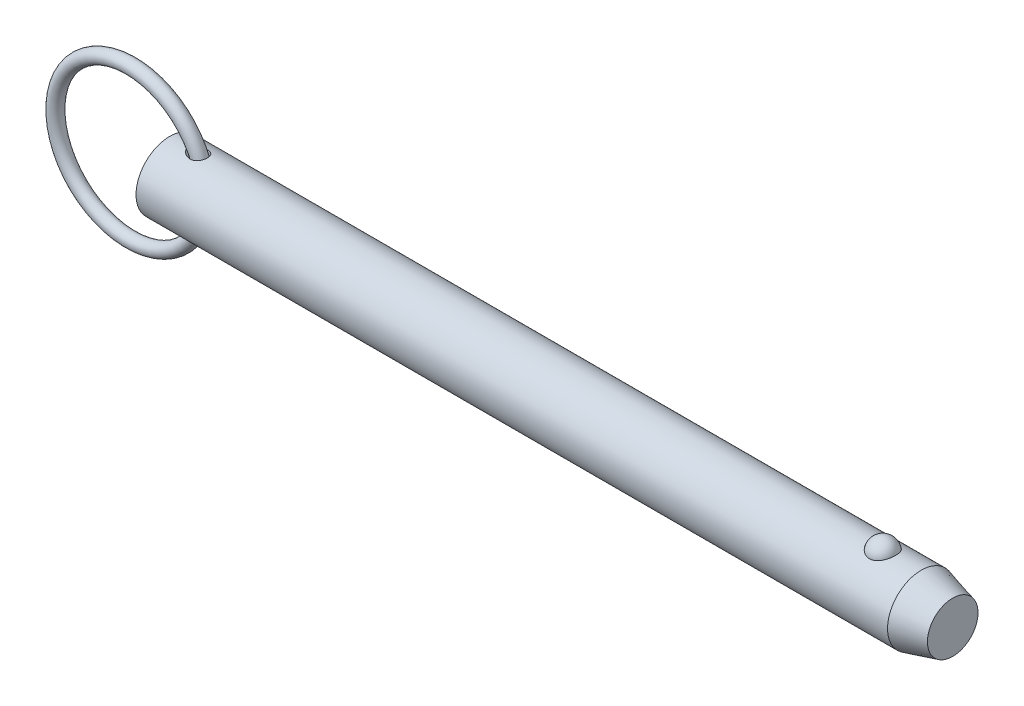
ISO-10303-21;
HEADER;
FILE_DESCRIPTION(('STEP AP214'),'2;1');
FILE_NAME('part.step','',(''),(''),'','','');
FILE_SCHEMA(('AUTOMOTIVE_DESIGN { 1 0 10303 214 1 1 1 1 }'));
ENDSEC;
DATA;
#1=APPLICATION_CONTEXT('core data for automotive mechanical design processes');
#2=APPLICATION_PROTOCOL_DEFINITION('international standard','automotive_design',2000,#1);
#3=PRODUCT_CONTEXT('',#1,'mechanical');
#4=PRODUCT('Part','Part','',(#3));
#5=PRODUCT_RELATED_PRODUCT_CATEGORY('part','',(#4));
#6=PRODUCT_DEFINITION_FORMATION('','',#4);
#7=PRODUCT_DEFINITION_CONTEXT('part definition',#1,'design');
#8=PRODUCT_DEFINITION('design','',#6,#7);
#9=PRODUCT_DEFINITION_SHAPE('','',#8);
#10=(LENGTH_UNIT() NAMED_UNIT(*) SI_UNIT(.MILLI.,.METRE.));
#11=(NAMED_UNIT(*) PLANE_ANGLE_UNIT() SI_UNIT($,.RADIAN.));
#12=(NAMED_UNIT(*) SI_UNIT($,.STERADIAN.) SOLID_ANGLE_UNIT());
#13=UNCERTAINTY_MEASURE_WITH_UNIT(LENGTH_MEASURE(1.E-05),#10,'distance_accuracy_value','');
#14=(GEOMETRIC_REPRESENTATION_CONTEXT(3) GLOBAL_UNCERTAINTY_ASSIGNED_CONTEXT((#13)) GLOBAL_UNIT_ASSIGNED_CONTEXT((#10,
#11,#12)) REPRESENTATION_CONTEXT('',''));
#15=CARTESIAN_POINT('',(0.,0.,0.));
#16=DIRECTION('',(0.,0.,1.));
#17=DIRECTION('',(1.,0.,0.));
#18=AXIS2_PLACEMENT_3D('',#15,#16,#17);
#19=CARTESIAN_POINT('',(-8.23730968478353,0.,0.));
#20=DIRECTION('',(0.,0.,1.));
#21=DIRECTION('',(1.,0.,0.));
#22=AXIS2_PLACEMENT_3D('',#19,#20,#21);
#23=TOROIDAL_SURFACE('',#22,15.875,1.422);
#24=CARTESIAN_POINT('',(9.05969031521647,0.,0.));
#25=VERTEX_POINT('',#24);
#26=VERTEX_LOOP('',#25);
#27=FACE_BOUND('',#26,.T.);
#28=ADVANCED_FACE('P0_F12',(#27),#23,.T.);
#29=CLOSED_SHELL('',(#28));
#30=MANIFOLD_SOLID_BREP('P0_B1',#29);
#31=CARTESIAN_POINT('',(0.,0.,0.));
#32=DIRECTION('',(1.,0.,0.));
#33=DIRECTION('',(0.,0.,-1.));
#34=AXIS2_PLACEMENT_3D('',#31,#32,#33);
#35=CYLINDRICAL_SURFACE('',#34,7.11);
#36=CARTESIAN_POINT('',(3.98467340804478,7.10072679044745,-0.363013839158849));
#37=CARTESIAN_POINT('',(4.00971652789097,7.09600153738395,-0.45539194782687));
#38=CARTESIAN_POINT('',(4.04401947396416,7.08958406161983,-0.545230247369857));
#39=CARTESIAN_POINT('',(4.12810160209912,7.07427055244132,-0.717157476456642));
#40=CARTESIAN_POINT('',(4.17791765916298,7.06536861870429,-0.799227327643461));
#41=CARTESIAN_POINT('',(4.28924471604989,7.04620300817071,-0.953469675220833));
#42=CARTESIAN_POINT('',(4.35063580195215,7.035953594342,-1.02573162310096));
#43=CARTESIAN_POINT('',(4.48282610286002,7.01493313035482,-1.16081412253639));
#44=CARTESIAN_POINT('',(4.55362244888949,7.00416223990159,-1.22363754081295));
#45=CARTESIAN_POINT('',(4.71659336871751,6.98090398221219,-1.35055080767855));
#46=CARTESIAN_POINT('',(4.81029272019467,6.96847103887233,-1.41269256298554));
#47=CARTESIAN_POINT('',(5.0057240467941,6.94515366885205,-1.52319699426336));
#48=CARTESIAN_POINT('',(5.10746392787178,6.93427079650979,-1.57154588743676));
#49=CARTESIAN_POINT('',(5.33503739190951,6.91346066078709,-1.66091325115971));
#50=CARTESIAN_POINT('',(5.46199550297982,6.90402388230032,-1.69921932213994));
#51=CARTESIAN_POINT('',(5.72084799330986,6.89024030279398,-1.75428261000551));
#52=CARTESIAN_POINT('',(5.85274301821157,6.88589416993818,-1.77103699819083));
#53=CARTESIAN_POINT('',(6.11557710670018,6.88337277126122,-1.78081990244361));
#54=CARTESIAN_POINT('',(6.24650031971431,6.88510489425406,-1.77420448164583));
#55=CARTESIAN_POINT('',(6.50446311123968,6.89478744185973,-1.73620392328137));
#56=CARTESIAN_POINT('',(6.6315075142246,6.90272978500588,-1.70485097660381));
#57=CARTESIAN_POINT('',(6.85933269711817,6.92243075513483,-1.62281888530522));
#58=CARTESIAN_POINT('',(6.96133251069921,6.93352131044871,-1.5753580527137));
#59=CARTESIAN_POINT('',(7.15436649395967,6.95824811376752,-1.46226310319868));
#60=CARTESIAN_POINT('',(7.24540699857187,6.97188287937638,-1.3966395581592));
#61=CARTESIAN_POINT('',(7.40446019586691,6.99838217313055,-1.25668991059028));
#62=CARTESIAN_POINT('',(7.473875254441,7.01118308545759,-1.18393777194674));
#63=CARTESIAN_POINT('',(7.59904891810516,7.03582803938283,-1.02736918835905));
#64=CARTESIAN_POINT('',(7.65481029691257,7.04767227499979,-0.943554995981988));
#65=CARTESIAN_POINT('',(7.74982438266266,7.06873077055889,-0.76979592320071));
#66=CARTESIAN_POINT('',(7.7894903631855,7.07800861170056,-0.680084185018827));
#67=CARTESIAN_POINT('',(7.85354088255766,7.09334756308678,-0.495102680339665));
#68=CARTESIAN_POINT('',(7.87792559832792,7.09940871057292,-0.399832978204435));
#69=CARTESIAN_POINT('',(7.9108898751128,7.10766731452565,-0.206294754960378));
#70=CARTESIAN_POINT('',(7.91944662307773,7.10985919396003,-0.108022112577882));
#71=CARTESIAN_POINT('',(7.920501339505,7.11012756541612,0.0886168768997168));
#72=CARTESIAN_POINT('',(7.91299895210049,7.10820396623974,0.186983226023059));
#73=CARTESIAN_POINT('',(7.88205794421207,7.10043733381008,0.381270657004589));
#74=CARTESIAN_POINT('',(7.85857985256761,7.09458459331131,0.477185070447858));
#75=CARTESIAN_POINT('',(7.79617406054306,7.07958431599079,0.663575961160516));
#76=CARTESIAN_POINT('',(7.75724672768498,7.07043685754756,0.754052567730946));
#77=CARTESIAN_POINT('',(7.66496731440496,7.04987259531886,0.926798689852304));
#78=CARTESIAN_POINT('',(7.61164530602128,7.0384605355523,1.00908483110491));
#79=CARTESIAN_POINT('',(7.49191707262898,7.01461776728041,1.16333092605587));
#80=CARTESIAN_POINT('',(7.42551210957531,7.00218715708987,1.235291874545));
#81=CARTESIAN_POINT('',(7.28164031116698,6.97770944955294,1.36680167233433));
#82=CARTESIAN_POINT('',(7.20420170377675,6.96566146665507,1.42638126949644));
#83=CARTESIAN_POINT('',(7.0403906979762,6.94319963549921,1.53199377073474));
#84=CARTESIAN_POINT('',(6.95401827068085,6.93278579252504,1.57802663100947));
#85=CARTESIAN_POINT('',(6.7731858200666,6.91444459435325,1.65656940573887));
#86=CARTESIAN_POINT('',(6.67860569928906,6.90656682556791,1.68881327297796));
#87=CARTESIAN_POINT('',(6.48544119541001,6.89422806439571,1.73849768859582));
#88=CARTESIAN_POINT('',(6.38685561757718,6.88976809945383,1.755933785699));
#89=CARTESIAN_POINT('',(6.18089829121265,6.88429907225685,1.77726234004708));
#90=CARTESIAN_POINT('',(6.07340937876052,6.88356485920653,1.78007646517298));
#91=CARTESIAN_POINT('',(5.85921220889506,6.886086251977,1.77029087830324));
#92=CARTESIAN_POINT('',(5.75250426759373,6.88934339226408,1.75768523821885));
#93=CARTESIAN_POINT('',(5.52848027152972,6.89994454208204,1.71563399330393));
#94=CARTESIAN_POINT('',(5.41155168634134,6.90775772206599,1.68424184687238));
#95=CARTESIAN_POINT('',(5.18376466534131,6.92670168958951,1.60454711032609));
#96=CARTESIAN_POINT('',(5.07291446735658,6.9378368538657,1.5562221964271));
#97=CARTESIAN_POINT('',(4.84835244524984,6.96347168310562,1.43744827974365));
#98=CARTESIAN_POINT('',(4.73562531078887,6.97820486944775,1.36517310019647));
#99=CARTESIAN_POINT('',(4.52504912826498,7.00822340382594,1.20158053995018));
#100=CARTESIAN_POINT('',(4.42717478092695,7.02350775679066,1.11029618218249));
#101=CARTESIAN_POINT('',(4.27935716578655,7.04784659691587,0.940654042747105));
#102=CARTESIAN_POINT('',(4.2239722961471,7.05736064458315,0.867099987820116));
#103=CARTESIAN_POINT('',(4.12558347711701,7.07469854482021,0.711919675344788));
#104=CARTESIAN_POINT('',(4.08256922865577,7.0825238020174,0.630300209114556));
#105=CARTESIAN_POINT('',(4.01142860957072,7.09565978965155,0.459428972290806));
#106=CARTESIAN_POINT('',(3.98346043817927,7.10094374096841,0.370107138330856));
#107=CARTESIAN_POINT('',(3.95517285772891,7.1063173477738,0.233358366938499));
#108=CARTESIAN_POINT('',(3.94802115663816,7.1076831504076,0.187321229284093));
#109=CARTESIAN_POINT('',(3.93842121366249,7.10951900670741,0.0947476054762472));
#110=CARTESIAN_POINT('',(3.93597129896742,7.10998937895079,0.0482113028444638));
#111=CARTESIAN_POINT('',(3.93584361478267,7.11001358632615,-0.0598597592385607));
#112=CARTESIAN_POINT('',(3.9399538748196,7.10922402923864,-0.121405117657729));
#113=CARTESIAN_POINT('',(3.95632793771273,7.10609781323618,-0.243320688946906));
#114=CARTESIAN_POINT('',(3.96859135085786,7.10376122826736,-0.303690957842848));
#115=CARTESIAN_POINT('',(3.98467340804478,7.10072679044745,-0.363013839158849));
#116=B_SPLINE_CURVE_WITH_KNOTS('',3,(#36,#37,#38,#39,#40,#41,#42,#43,#44,#45,#46,#47,#48,#49,
#50,#51,#52,#53,#54,#55,#56,#57,#58,#59,#60,#61,#62,#63,#64,#65,#66,#67,#68,#69,#70,#71,#72,#73,
#74,#75,#76,#77,#78,#79,#80,#81,#82,#83,#84,#85,#86,#87,#88,#89,#90,#91,#92,#93,#94,#95,#96,#97,
#98,#99,#100,#101,#102,#103,#104,#105,#106,#107,#108,#109,#110,#111,#112,#113,#114,#115),
.UNSPECIFIED.,.T.,.F.,(4,2,2,2,2,2,2,2,2,2,2,2,2,2,2,2,2,2,2,2,2,2,2,2,2,2,2,2,2,2,2,2,2,2,2,2,
2,2,2,4),(0.,0.287206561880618,0.575101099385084,0.860162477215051,1.14513709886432,
1.48324846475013,1.82169652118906,2.21865672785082,2.6156690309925,3.00665870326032,
3.39714041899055,3.73437585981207,4.07141541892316,4.37402271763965,4.67656849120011,
4.97076150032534,5.26495110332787,5.55956439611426,5.85418421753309,6.14953461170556,
6.44487798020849,6.73960905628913,7.03431171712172,7.32827352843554,7.6222362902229,
7.9216396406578,8.22113296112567,8.54242840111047,8.86384740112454,9.22635035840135,
9.58933304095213,9.99153142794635,10.3930368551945,10.6697219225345,10.9461759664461,
11.2254825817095,11.3650959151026,11.5046595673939,11.6891051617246,11.8735419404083),.UNSPECIFIED.);
#117=CARTESIAN_POINT('',(3.98467340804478,7.10072679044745,-0.363013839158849));
#118=VERTEX_POINT('',#117);
#119=EDGE_CURVE('P1_E40',#118,#118,#116,.T.);
#120=ORIENTED_EDGE('',*,*,#119,.T.);
#121=EDGE_LOOP('',(#120));
#122=FACE_BOUND('',#121,.T.);
#123=CARTESIAN_POINT('',(158.436279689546,0.,0.));
#124=DIRECTION('',(1.,0.,0.));
#125=DIRECTION('',(0.,0.,-1.));
#126=AXIS2_PLACEMENT_3D('',#123,#124,#125);
#127=CIRCLE('',#126,7.11);
#128=CARTESIAN_POINT('',(158.436279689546,0.,-7.11));
#129=VERTEX_POINT('',#128);
#130=EDGE_CURVE('P1_E25',#129,#129,#127,.T.);
#131=ORIENTED_EDGE('',*,*,#130,.F.);
#132=EDGE_LOOP('',(#131));
#133=FACE_BOUND('',#132,.T.);
#134=CARTESIAN_POINT('',(0.,0.,0.));
#135=DIRECTION('',(1.,0.,0.));
#136=DIRECTION('',(0.,0.,-1.));
#137=AXIS2_PLACEMENT_3D('',#134,#135,#136);
#138=CIRCLE('',#137,7.11);
#139=CARTESIAN_POINT('',(0.,0.,-7.11));
#140=VERTEX_POINT('',#139);
#141=EDGE_CURVE('P1_E9',#140,#140,#138,.T.);
#142=ORIENTED_EDGE('',*,*,#141,.T.);
#143=EDGE_LOOP('',(#142));
#144=FACE_BOUND('',#143,.T.);
#145=CARTESIAN_POINT('',(150.329258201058,6.53646663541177,2.79762469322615));
#146=CARTESIAN_POINT('',(150.184429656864,6.53647876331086,2.79761243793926));
#147=CARTESIAN_POINT('',(150.039368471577,6.54144531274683,2.7860811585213));
#148=CARTESIAN_POINT('',(149.753292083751,6.56077791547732,2.74023282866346));
#149=CARTESIAN_POINT('',(149.61228845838,6.57516852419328,2.70585624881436));
#150=CARTESIAN_POINT('',(149.33888335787,6.61165072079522,2.61544042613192));
#151=CARTESIAN_POINT('',(149.206460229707,6.63372195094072,2.55945840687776));
#152=CARTESIAN_POINT('',(148.953233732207,6.68316012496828,2.4274295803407));
#153=CARTESIAN_POINT('',(148.832425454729,6.71052481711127,2.35139129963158));
#154=CARTESIAN_POINT('',(148.601637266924,6.76860821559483,2.17866150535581));
#155=CARTESIAN_POINT('',(148.492085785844,6.79940242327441,2.08142342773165));
#156=CARTESIAN_POINT('',(148.29033404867,6.86050242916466,1.87020907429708));
#157=CARTESIAN_POINT('',(148.198139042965,6.89080807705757,1.75622775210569));
#158=CARTESIAN_POINT('',(148.02925478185,6.94923069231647,1.50900646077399));
#159=CARTESIAN_POINT('',(147.953428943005,6.97719213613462,1.37513873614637));
#160=CARTESIAN_POINT('',(147.824206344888,7.02647251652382,1.09584817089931));
#161=CARTESIAN_POINT('',(147.770810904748,7.04779106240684,0.950424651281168));
#162=CARTESIAN_POINT('',(147.687101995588,7.08180248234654,0.650508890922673));
#163=CARTESIAN_POINT('',(147.657025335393,7.09440672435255,0.495940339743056));
#164=CARTESIAN_POINT('',(147.621473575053,7.10935121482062,0.183515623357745));
#165=CARTESIAN_POINT('',(147.615997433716,7.11169189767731,0.0256595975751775));
#166=CARTESIAN_POINT('',(147.629700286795,7.10589702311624,-0.287512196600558));
#167=CARTESIAN_POINT('',(147.64868231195,7.0978451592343,-0.442838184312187));
#168=CARTESIAN_POINT('',(147.71057450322,7.07221860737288,-0.747830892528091));
#169=CARTESIAN_POINT('',(147.753485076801,7.05464375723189,-0.897497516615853));
#170=CARTESIAN_POINT('',(147.862452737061,7.01171031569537,-1.18722864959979));
#171=CARTESIAN_POINT('',(147.928545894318,6.98633960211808,-1.32727778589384));
#172=CARTESIAN_POINT('',(148.082536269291,6.93042258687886,-1.59370324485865));
#173=CARTESIAN_POINT('',(148.170435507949,6.89987580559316,-1.72007829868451));
#174=CARTESIAN_POINT('',(148.366926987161,6.83659510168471,-1.95657345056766));
#175=CARTESIAN_POINT('',(148.475664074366,6.80384697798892,-2.06656957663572));
#176=CARTESIAN_POINT('',(148.710968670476,6.74001831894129,-2.26611005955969));
#177=CARTESIAN_POINT('',(148.837535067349,6.7089376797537,-2.35565569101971));
#178=CARTESIAN_POINT('',(149.102845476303,6.65264442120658,-2.51019726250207));
#179=CARTESIAN_POINT('',(149.241323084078,6.62733449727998,-2.57561395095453));
#180=CARTESIAN_POINT('',(149.528519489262,6.58495995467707,-2.68211134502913));
#181=CARTESIAN_POINT('',(149.677234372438,6.56789220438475,-2.72320129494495));
#182=CARTESIAN_POINT('',(149.972626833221,6.54478663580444,-2.77825810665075));
#183=CARTESIAN_POINT('',(150.119029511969,6.53823639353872,-2.79348727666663));
#184=CARTESIAN_POINT('',(150.412470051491,6.53532718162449,-2.80028921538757));
#185=CARTESIAN_POINT('',(150.559507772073,6.538966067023,-2.79186696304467));
#186=CARTESIAN_POINT('',(150.844921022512,6.55570357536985,-2.75232178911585));
#187=CARTESIAN_POINT('',(150.983422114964,6.56848455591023,-2.72196077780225));
#188=CARTESIAN_POINT('',(151.253114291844,6.60173528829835,-2.6402877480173));
#189=CARTESIAN_POINT('',(151.384304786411,6.6222056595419,-2.58897404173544));
#190=CARTESIAN_POINT('',(151.638846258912,6.66917927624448,-2.46547820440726));
#191=CARTESIAN_POINT('',(151.761969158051,6.69580233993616,-2.39287266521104));
#192=CARTESIAN_POINT('',(151.994441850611,6.75207041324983,-2.22915269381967));
#193=CARTESIAN_POINT('',(152.103788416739,6.78171612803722,-2.13803393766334));
#194=CARTESIAN_POINT('',(152.311642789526,6.8426462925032,-1.93445592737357));
#195=CARTESIAN_POINT('',(152.409317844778,6.8739374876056,-1.82114774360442));
#196=CARTESIAN_POINT('',(152.585011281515,6.93345710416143,-1.57947787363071));
#197=CARTESIAN_POINT('',(152.663026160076,6.96168497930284,-1.45111351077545));
#198=CARTESIAN_POINT('',(152.799985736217,7.0130755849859,-1.17842708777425));
#199=CARTESIAN_POINT('',(152.858258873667,7.03605262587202,-1.03373189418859));
#200=CARTESIAN_POINT('',(152.951081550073,7.07340932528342,-0.735867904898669));
#201=CARTESIAN_POINT('',(152.985631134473,7.08778900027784,-0.582699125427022));
#202=CARTESIAN_POINT('',(153.030274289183,7.10647639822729,-0.272420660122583));
#203=CARTESIAN_POINT('',(153.04039710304,7.11079616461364,-0.115315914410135));
#204=CARTESIAN_POINT('',(153.036061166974,7.10896059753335,0.198488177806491));
#205=CARTESIAN_POINT('',(153.021603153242,7.10280557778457,0.355187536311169));
#206=CARTESIAN_POINT('',(152.968572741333,7.08071500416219,0.662724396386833));
#207=CARTESIAN_POINT('',(152.93015058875,7.06484039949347,0.81359224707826));
#208=CARTESIAN_POINT('',(152.830101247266,7.02495896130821,1.10629159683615));
#209=CARTESIAN_POINT('',(152.768472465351,7.00095156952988,1.24812247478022));
#210=CARTESIAN_POINT('',(152.622766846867,6.94706632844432,1.51976439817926));
#211=CARTESIAN_POINT('',(152.538544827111,6.91715085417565,1.64949012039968));
#212=CARTESIAN_POINT('',(152.349586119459,6.8547056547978,1.89231285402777));
#213=CARTESIAN_POINT('',(152.244850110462,6.82217601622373,2.0054104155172));
#214=CARTESIAN_POINT('',(152.017103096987,6.75805358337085,2.21190674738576));
#215=CARTESIAN_POINT('',(151.894082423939,6.72646129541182,2.30529503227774));
#216=CARTESIAN_POINT('',(151.63273470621,6.66789520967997,2.46959908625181));
#217=CARTESIAN_POINT('',(151.494401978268,6.64092313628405,2.54050647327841));
#218=CARTESIAN_POINT('',(151.211182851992,6.59572583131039,2.6556004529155));
#219=CARTESIAN_POINT('',(151.066666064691,6.57724013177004,2.70059539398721));
#220=CARTESIAN_POINT('',(150.771546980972,6.55006426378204,2.76587321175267));
#221=CARTESIAN_POINT('',(150.620964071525,6.54134511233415,2.78622922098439));
#222=CARTESIAN_POINT('',(150.423046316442,6.53697847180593,2.79642434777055));
#223=CARTESIAN_POINT('',(150.376164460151,6.53646270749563,2.79762866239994));
#224=CARTESIAN_POINT('',(150.329258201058,6.53646663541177,2.79762469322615));
#225=B_SPLINE_CURVE_WITH_KNOTS('',3,(#145,#146,#147,#148,#149,#150,#151,#152,#153,#154,#155,
#156,#157,#158,#159,#160,#161,#162,#163,#164,#165,#166,#167,#168,#169,#170,#171,#172,#173,#174,
#175,#176,#177,#178,#179,#180,#181,#182,#183,#184,#185,#186,#187,#188,#189,#190,#191,#192,#193,
#194,#195,#196,#197,#198,#199,#200,#201,#202,#203,#204,#205,#206,#207,#208,#209,#210,#211,#212,
#213,#214,#215,#216,#217,#218,#219,#220,#221,#222,#223,#224),.UNSPECIFIED.,.T.,.F.,(4,2,2,2,2,2,
2,2,2,2,2,2,2,2,2,2,2,2,2,2,2,2,2,2,2,2,2,2,2,2,2,2,2,2,2,2,2,2,2,4),(0.,0.43435572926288,
0.869847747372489,1.30419416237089,1.738356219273,2.18541922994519,2.63261726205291,
3.09954261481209,3.56649542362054,4.03813031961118,4.50974525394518,4.9775857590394,
5.44543423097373,5.9140138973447,6.38263700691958,6.85464418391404,7.32662193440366,
7.78992971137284,8.25306131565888,8.69285754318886,9.13256119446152,9.55768625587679,
9.98284556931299,10.417110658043,10.8514772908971,11.3079089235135,11.7644218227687,
12.2351898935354,12.7059570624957,13.1761603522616,13.6463495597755,14.1136200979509,
14.5809227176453,15.0513032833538,15.5216682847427,15.9922828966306,16.4630727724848,
16.9182457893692,17.3720644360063,17.5127411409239),.UNSPECIFIED.);
#226=CARTESIAN_POINT('',(150.329258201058,6.53646663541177,2.79762469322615));
#227=VERTEX_POINT('',#226);
#228=EDGE_CURVE('P1_E34',#227,#227,#225,.T.);
#229=ORIENTED_EDGE('',*,*,#228,.T.);
#230=EDGE_LOOP('',(#229));
#231=FACE_BOUND('',#230,.T.);
#232=CARTESIAN_POINT('',(3.98467340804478,-7.10072679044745,-0.363013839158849));
#233=CARTESIAN_POINT('',(3.96426456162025,-7.10457733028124,-0.287714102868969));
#234=CARTESIAN_POINT('',(3.95000501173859,-7.10730349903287,-0.210695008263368));
#235=CARTESIAN_POINT('',(3.93481801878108,-7.11020840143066,-0.0553038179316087));
#236=CARTESIAN_POINT('',(3.93388435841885,-7.11038832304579,0.0230676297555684));
#237=CARTESIAN_POINT('',(3.94541910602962,-7.10817995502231,0.178714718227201));
#238=CARTESIAN_POINT('',(3.95787987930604,-7.10579312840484,0.25599095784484));
#239=CARTESIAN_POINT('',(3.99523775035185,-7.09872642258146,0.407352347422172));
#240=CARTESIAN_POINT('',(4.02014065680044,-7.09404547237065,0.481435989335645));
#241=CARTESIAN_POINT('',(4.08119600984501,-7.08278363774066,0.625775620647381));
#242=CARTESIAN_POINT('',(4.11749458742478,-7.07617815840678,0.695967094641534));
#243=CARTESIAN_POINT('',(4.19940836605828,-7.06165305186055,0.830508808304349));
#244=CARTESIAN_POINT('',(4.24502952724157,-7.0537325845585,0.894855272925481));
#245=CARTESIAN_POINT('',(4.36790232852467,-7.03310314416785,1.04688574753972));
#246=CARTESIAN_POINT('',(4.44977459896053,-7.01993229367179,1.13078695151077));
#247=CARTESIAN_POINT('',(4.62610796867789,-6.99351259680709,1.28411726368));
#248=CARTESIAN_POINT('',(4.7205898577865,-6.98026365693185,1.35352197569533));
#249=CARTESIAN_POINT('',(4.92036507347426,-6.9549104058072,1.47831921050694));
#250=CARTESIAN_POINT('',(5.02579054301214,-6.94282458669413,1.53350332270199));
#251=CARTESIAN_POINT('',(5.24378330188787,-6.92129098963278,1.62793610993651));
#252=CARTESIAN_POINT('',(5.35635066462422,-6.91184323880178,1.66718462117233));
#253=CARTESIAN_POINT('',(5.60134354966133,-6.89573491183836,1.73269893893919));
#254=CARTESIAN_POINT('',(5.73444697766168,-6.8895970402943,1.75661057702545));
#255=CARTESIAN_POINT('',(6.00300738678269,-6.88344616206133,1.78057487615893));
#256=CARTESIAN_POINT('',(6.13846360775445,-6.88343121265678,1.78063510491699));
#257=CARTESIAN_POINT('',(6.39660470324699,-6.88981379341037,1.75576480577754));
#258=CARTESIAN_POINT('',(6.51947843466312,-6.89572457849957,1.73273121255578));
#259=CARTESIAN_POINT('',(6.75813770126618,-6.91274434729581,1.66352936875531));
#260=CARTESIAN_POINT('',(6.87393155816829,-6.92384709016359,1.61738888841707));
#261=CARTESIAN_POINT('',(7.07801861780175,-6.94787316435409,1.51052664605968));
#262=CARTESIAN_POINT('',(7.16789841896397,-6.96033024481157,1.45271574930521));
#263=CARTESIAN_POINT('',(7.33546773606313,-6.98638661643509,1.32171912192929));
#264=CARTESIAN_POINT('',(7.41316182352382,-6.99998547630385,1.24853918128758));
#265=CARTESIAN_POINT('',(7.54861420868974,-7.02559503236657,1.09486170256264));
#266=CARTESIAN_POINT('',(7.60741145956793,-7.03764930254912,1.01528346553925));
#267=CARTESIAN_POINT('',(7.71070740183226,-7.0598657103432,0.847099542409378));
#268=CARTESIAN_POINT('',(7.75520788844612,-7.0700280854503,0.758494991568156));
#269=CARTESIAN_POINT('',(7.82836147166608,-7.08722075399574,0.575936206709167));
#270=CARTESIAN_POINT('',(7.85719783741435,-7.09428707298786,0.482058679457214));
#271=CARTESIAN_POINT('',(7.89918378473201,-7.10470260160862,0.29065874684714));
#272=CARTESIAN_POINT('',(7.91233308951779,-7.10805174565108,0.193136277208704));
#273=CARTESIAN_POINT('',(7.92267451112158,-7.11067890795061,-0.00313968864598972));
#274=CARTESIAN_POINT('',(7.91981203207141,-7.10994299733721,-0.10189624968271));
#275=CARTESIAN_POINT('',(7.89806489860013,-7.10444651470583,-0.297516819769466));
#276=CARTESIAN_POINT('',(7.87918005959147,-7.09968589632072,-0.394380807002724));
#277=CARTESIAN_POINT('',(7.82577988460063,-7.0866471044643,-0.58355375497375));
#278=CARTESIAN_POINT('',(7.79124976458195,-7.07836560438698,-0.675858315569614));
#279=CARTESIAN_POINT('',(7.70736343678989,-7.05919003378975,-0.853167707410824));
#280=CARTESIAN_POINT('',(7.65800801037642,-7.04829610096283,-0.938172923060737));
#281=CARTESIAN_POINT('',(7.54590141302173,-7.02513961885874,-1.09819812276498));
#282=CARTESIAN_POINT('',(7.48319521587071,-7.01288172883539,-1.17325029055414));
#283=CARTESIAN_POINT('',(7.34599775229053,-6.98832192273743,-1.31164333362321));
#284=CARTESIAN_POINT('',(7.27150757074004,-6.97602001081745,-1.37498528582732));
#285=CARTESIAN_POINT('',(7.11277776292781,-6.95268608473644,-1.48849974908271));
#286=CARTESIAN_POINT('',(7.02852525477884,-6.94165578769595,-1.53865456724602));
#287=CARTESIAN_POINT('',(6.85282430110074,-6.92200320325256,-1.62478650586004));
#288=CARTESIAN_POINT('',(6.76137511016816,-6.91338116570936,-1.66076215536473));
#289=CARTESIAN_POINT('',(6.57061179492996,-6.89906044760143,-1.71930563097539));
#290=CARTESIAN_POINT('',(6.47113516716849,-6.89347290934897,-1.74136795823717));
#291=CARTESIAN_POINT('',(6.26989833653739,-6.88605020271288,-1.7704895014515));
#292=CARTESIAN_POINT('',(6.16813737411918,-6.88421630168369,-1.77754365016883));
#293=CARTESIAN_POINT('',(5.95492537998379,-6.88424071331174,-1.77745174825));
#294=CARTESIAN_POINT('',(5.8434768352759,-6.88646827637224,-1.76888555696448));
#295=CARTESIAN_POINT('',(5.62307560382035,-6.89483827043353,-1.73596677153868));
#296=CARTESIAN_POINT('',(5.51412477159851,-6.90098351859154,-1.71160281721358));
#297=CARTESIAN_POINT('',(5.28644478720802,-6.91743803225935,-1.64393691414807));
#298=CARTESIAN_POINT('',(5.16837217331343,-6.92819628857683,-1.59852806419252));
#299=CARTESIAN_POINT('',(4.94091825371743,-6.95234836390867,-1.4899796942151));
#300=CARTESIAN_POINT('',(4.83153887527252,-6.96574276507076,-1.42683625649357));
#301=CARTESIAN_POINT('',(4.63576710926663,-6.99209234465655,-1.29112257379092));
#302=CARTESIAN_POINT('',(4.54816728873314,-7.00494184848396,-1.22027748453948));
#303=CARTESIAN_POINT('',(4.38554897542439,-7.03019055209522,-1.0652111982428));
#304=CARTESIAN_POINT('',(4.31052141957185,-7.04259007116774,-0.980999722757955));
#305=CARTESIAN_POINT('',(4.18551811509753,-7.0640229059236,-0.811206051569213));
#306=CARTESIAN_POINT('',(4.13358417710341,-7.07328321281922,-0.727107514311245));
#307=CARTESIAN_POINT('',(4.04607461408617,-7.0891994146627,-0.550580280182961));
#308=CARTESIAN_POINT('',(4.01046401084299,-7.09586087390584,-0.458169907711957));
#309=CARTESIAN_POINT('',(3.98467340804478,-7.10072679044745,-0.363013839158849));
#310=B_SPLINE_CURVE_WITH_KNOTS('',3,(#232,#233,#234,#235,#236,#237,#238,#239,#240,#241,#242,
#243,#244,#245,#246,#247,#248,#249,#250,#251,#252,#253,#254,#255,#256,#257,#258,#259,#260,#261,
#262,#263,#264,#265,#266,#267,#268,#269,#270,#271,#272,#273,#274,#275,#276,#277,#278,#279,#280,
#281,#282,#283,#284,#285,#286,#287,#288,#289,#290,#291,#292,#293,#294,#295,#296,#297,#298,#299,
#300,#301,#302,#303,#304,#305,#306,#307,#308,#309),.UNSPECIFIED.,.T.,.F.,(4,2,2,2,2,2,2,2,2,2,2,
2,2,2,2,2,2,2,2,2,2,2,2,2,2,2,2,2,2,2,2,2,2,2,2,2,2,2,4),(0.,0.23402065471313,0.467932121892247,
0.701710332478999,0.935597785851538,1.17261620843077,1.40978663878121,1.76177576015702,
2.11435255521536,2.47183528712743,2.8293216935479,3.23332937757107,3.63720887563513,
4.01042610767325,4.38319587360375,4.70425151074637,5.02518641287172,5.32277979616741,
5.62033579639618,5.91433101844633,6.2083314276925,6.50333490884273,6.79834178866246,
7.09362801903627,7.38889868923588,7.6831900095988,7.9774542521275,8.27211131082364,
8.56679892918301,8.8716552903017,9.17661456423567,9.51069129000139,9.84500851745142,
10.2243046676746,10.6036846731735,10.9425776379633,11.2812252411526,11.5775945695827,
11.8733258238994),.UNSPECIFIED.);
#311=CARTESIAN_POINT('',(3.98467340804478,-7.10072679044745,-0.363013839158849));
#312=VERTEX_POINT('',#311);
#313=EDGE_CURVE('P1_E17',#312,#312,#310,.T.);
#314=ORIENTED_EDGE('',*,*,#313,.T.);
#315=EDGE_LOOP('',(#314));
#316=FACE_BOUND('',#315,.T.);
#317=ADVANCED_FACE('P1_F13',(#122,#133,#144,#231,#316),#35,.T.);
#318=CARTESIAN_POINT('',(0.,0.,0.));
#319=DIRECTION('',(-1.,0.,0.));
#320=DIRECTION('',(0.,0.,1.));
#321=AXIS2_PLACEMENT_3D('',#318,#319,#320);
#322=PLANE('',#321);
#323=ORIENTED_EDGE('',*,*,#141,.F.);
#324=EDGE_LOOP('',(#323));
#325=FACE_BOUND('',#324,.T.);
#326=ADVANCED_FACE('P1_F15',(#325),#322,.T.);
#327=CARTESIAN_POINT('',(165.07,0.,0.));
#328=DIRECTION('',(-1.,0.,0.));
#329=DIRECTION('',(0.,0.,1.));
#330=AXIS2_PLACEMENT_3D('',#327,#328,#329);
#331=CONICAL_SURFACE('',#330,5.33250000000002,0.26179938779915);
#332=ORIENTED_EDGE('',*,*,#130,.T.);
#333=EDGE_LOOP('',(#332));
#334=FACE_BOUND('',#333,.T.);
#335=CARTESIAN_POINT('',(165.07,0.,0.));
#336=DIRECTION('',(1.,0.,0.));
#337=DIRECTION('',(0.,0.,-1.));
#338=AXIS2_PLACEMENT_3D('',#335,#336,#337);
#339=CIRCLE('',#338,5.33250000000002);
#340=CARTESIAN_POINT('',(165.07,0.,-5.33250000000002));
#341=VERTEX_POINT('',#340);
#342=EDGE_CURVE('P1_E30',#341,#341,#339,.T.);
#343=ORIENTED_EDGE('',*,*,#342,.F.);
#344=EDGE_LOOP('',(#343));
#345=FACE_BOUND('',#344,.T.);
#346=ADVANCED_FACE('P1_F55',(#334,#345),#331,.T.);
#347=CARTESIAN_POINT('',(165.07,5.33250000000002,0.));
#348=DIRECTION('',(1.,0.,0.));
#349=DIRECTION('',(0.,0.,-1.));
#350=AXIS2_PLACEMENT_3D('',#347,#348,#349);
#351=PLANE('',#350);
#352=ORIENTED_EDGE('',*,*,#342,.T.);
#353=EDGE_LOOP('',(#352));
#354=FACE_BOUND('',#353,.T.);
#355=ADVANCED_FACE('P1_F51',(#354),#351,.T.);
#356=CARTESIAN_POINT('',(150.329258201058,6.399,0.));
#357=DIRECTION('',(-1.,0.,0.));
#358=DIRECTION('',(0.,-1.,0.));
#359=AXIS2_PLACEMENT_3D('',#356,#357,#358);
#360=SPHERICAL_SURFACE('',#359,2.80100000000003);
#361=ORIENTED_EDGE('',*,*,#228,.F.);
#362=EDGE_LOOP('',(#361));
#363=FACE_BOUND('',#362,.T.);
#364=ADVANCED_FACE('P1_F46',(#363),#360,.T.);
#365=CARTESIAN_POINT('',(-8.23730968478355,0.,0.));
#366=DIRECTION('',(0.,0.,1.));
#367=DIRECTION('',(1.,0.,0.));
#368=AXIS2_PLACEMENT_3D('',#365,#366,#367);
#369=TOROIDAL_SURFACE('',#368,15.875,1.7775);
#370=ORIENTED_EDGE('',*,*,#313,.F.);
#371=EDGE_LOOP('',(#370));
#372=FACE_BOUND('',#371,.T.);
#373=ORIENTED_EDGE('',*,*,#119,.F.);
#374=EDGE_LOOP('',(#373));
#375=FACE_BOUND('',#374,.T.);
#376=ADVANCED_FACE('P1_F50',(#372,#375),#369,.F.);
#377=CLOSED_SHELL('',(#317,#326,#346,#355,#364,#376));
#378=MANIFOLD_SOLID_BREP('P1_B1',#377);
#379=ADVANCED_BREP_SHAPE_REPRESENTATION('',(#18,#30,#378),#14);
#380=SHAPE_DEFINITION_REPRESENTATION(#9,#379);
ENDSEC;
END-ISO-10303-21;
